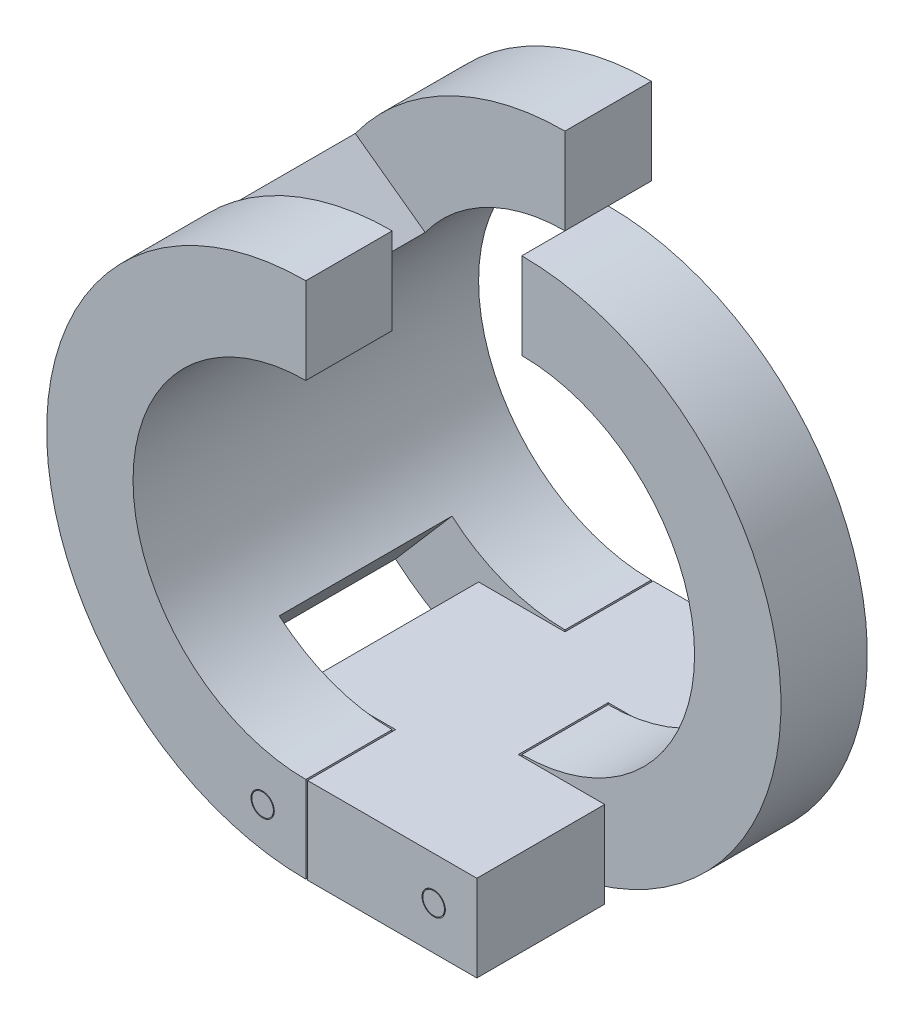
ISO-10303-21;
HEADER;
FILE_DESCRIPTION(('STEP AP214'),'2;1');
FILE_NAME('part.step','',(''),(''),'','','');
FILE_SCHEMA(('AUTOMOTIVE_DESIGN { 1 0 10303 214 1 1 1 1 }'));
ENDSEC;
DATA;
#1=APPLICATION_CONTEXT('core data for automotive mechanical design processes');
#2=APPLICATION_PROTOCOL_DEFINITION('international standard','automotive_design',2000,#1);
#3=PRODUCT_CONTEXT('',#1,'mechanical');
#4=PRODUCT('Part','Part','',(#3));
#5=PRODUCT_RELATED_PRODUCT_CATEGORY('part','',(#4));
#6=PRODUCT_DEFINITION_FORMATION('','',#4);
#7=PRODUCT_DEFINITION_CONTEXT('part definition',#1,'design');
#8=PRODUCT_DEFINITION('design','',#6,#7);
#9=PRODUCT_DEFINITION_SHAPE('','',#8);
#10=(LENGTH_UNIT() NAMED_UNIT(*) SI_UNIT(.MILLI.,.METRE.));
#11=(NAMED_UNIT(*) PLANE_ANGLE_UNIT() SI_UNIT($,.RADIAN.));
#12=(NAMED_UNIT(*) SI_UNIT($,.STERADIAN.) SOLID_ANGLE_UNIT());
#13=UNCERTAINTY_MEASURE_WITH_UNIT(LENGTH_MEASURE(1.E-05),#10,'distance_accuracy_value','');
#14=(GEOMETRIC_REPRESENTATION_CONTEXT(3) GLOBAL_UNCERTAINTY_ASSIGNED_CONTEXT((#13)) GLOBAL_UNIT_ASSIGNED_CONTEXT((#10,
#11,#12)) REPRESENTATION_CONTEXT('',''));
#15=CARTESIAN_POINT('',(0.,0.,0.));
#16=DIRECTION('',(0.,0.,1.));
#17=DIRECTION('',(1.,0.,0.));
#18=AXIS2_PLACEMENT_3D('',#15,#16,#17);
#19=CARTESIAN_POINT('',(9.398,-15.875,0.));
#20=DIRECTION('',(0.,0.,1.));
#21=DIRECTION('',(1.,0.,0.));
#22=AXIS2_PLACEMENT_3D('',#19,#20,#21);
#23=CYLINDRICAL_SURFACE('',#22,0.793749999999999);
#24=CARTESIAN_POINT('',(9.398,-15.875,0.));
#25=DIRECTION('',(0.,0.,1.));
#26=DIRECTION('',(1.,0.,0.));
#27=AXIS2_PLACEMENT_3D('',#24,#25,#26);
#28=CIRCLE('',#27,0.793749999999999);
#29=CARTESIAN_POINT('',(10.19175,-15.875,0.));
#30=VERTEX_POINT('',#29);
#31=EDGE_CURVE('E49',#30,#30,#28,.T.);
#32=ORIENTED_EDGE('',*,*,#31,.T.);
#33=EDGE_LOOP('',(#32));
#34=FACE_BOUND('',#33,.T.);
#35=CARTESIAN_POINT('',(9.398,-15.875,25.4));
#36=DIRECTION('',(0.,0.,1.));
#37=DIRECTION('',(1.,0.,0.));
#38=AXIS2_PLACEMENT_3D('',#35,#36,#37);
#39=CIRCLE('',#38,0.793749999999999);
#40=CARTESIAN_POINT('',(10.19175,-15.875,25.4));
#41=VERTEX_POINT('',#40);
#42=EDGE_CURVE('E11',#41,#41,#39,.T.);
#43=ORIENTED_EDGE('',*,*,#42,.F.);
#44=EDGE_LOOP('',(#43));
#45=FACE_BOUND('',#44,.T.);
#46=ADVANCED_FACE('F45',(#34,#45),#23,.T.);
#47=CARTESIAN_POINT('',(9.398,-15.875,0.));
#48=DIRECTION('',(0.,0.,1.));
#49=DIRECTION('',(1.,0.,0.));
#50=AXIS2_PLACEMENT_3D('',#47,#48,#49);
#51=PLANE('',#50);
#52=ORIENTED_EDGE('',*,*,#31,.F.);
#53=EDGE_LOOP('',(#52));
#54=FACE_BOUND('',#53,.T.);
#55=ADVANCED_FACE('F47',(#54),#51,.F.);
#56=CARTESIAN_POINT('',(9.398,-15.875,25.4));
#57=DIRECTION('',(0.,0.,1.));
#58=DIRECTION('',(1.,0.,0.));
#59=AXIS2_PLACEMENT_3D('',#56,#57,#58);
#60=PLANE('',#59);
#61=ORIENTED_EDGE('',*,*,#42,.T.);
#62=EDGE_LOOP('',(#61));
#63=FACE_BOUND('',#62,.T.);
#64=ADVANCED_FACE('F61',(#63),#60,.T.);
#65=CLOSED_SHELL('',(#46,#55,#64));
#66=MANIFOLD_SOLID_BREP('B2',#65);
#67=CARTESIAN_POINT('',(-3.175,-15.875,0.));
#68=DIRECTION('',(0.,0.,1.));
#69=DIRECTION('',(1.,0.,0.));
#70=AXIS2_PLACEMENT_3D('',#67,#68,#69);
#71=CYLINDRICAL_SURFACE('',#70,0.79375);
#72=CARTESIAN_POINT('',(-3.175,-15.875,0.));
#73=DIRECTION('',(0.,0.,1.));
#74=DIRECTION('',(1.,0.,0.));
#75=AXIS2_PLACEMENT_3D('',#72,#73,#74);
#76=CIRCLE('',#75,0.79375);
#77=CARTESIAN_POINT('',(-2.38125,-15.875,0.));
#78=VERTEX_POINT('',#77);
#79=EDGE_CURVE('E44',#78,#78,#76,.T.);
#80=ORIENTED_EDGE('',*,*,#79,.T.);
#81=EDGE_LOOP('',(#80));
#82=FACE_BOUND('',#81,.T.);
#83=CARTESIAN_POINT('',(-3.175,-15.875,25.4));
#84=DIRECTION('',(0.,0.,1.));
#85=DIRECTION('',(1.,0.,0.));
#86=AXIS2_PLACEMENT_3D('',#83,#84,#85);
#87=CIRCLE('',#86,0.79375);
#88=CARTESIAN_POINT('',(-2.38125,-15.875,25.4));
#89=VERTEX_POINT('',#88);
#90=EDGE_CURVE('E98',#89,#89,#87,.T.);
#91=ORIENTED_EDGE('',*,*,#90,.F.);
#92=EDGE_LOOP('',(#91));
#93=FACE_BOUND('',#92,.T.);
#94=ADVANCED_FACE('F95',(#82,#93),#71,.T.);
#95=CARTESIAN_POINT('',(-3.175,-15.875,0.));
#96=DIRECTION('',(0.,0.,1.));
#97=DIRECTION('',(1.,0.,0.));
#98=AXIS2_PLACEMENT_3D('',#95,#96,#97);
#99=PLANE('',#98);
#100=ORIENTED_EDGE('',*,*,#79,.F.);
#101=EDGE_LOOP('',(#100));
#102=FACE_BOUND('',#101,.T.);
#103=ADVANCED_FACE('F110',(#102),#99,.F.);
#104=CARTESIAN_POINT('',(-3.175,-15.875,25.4));
#105=DIRECTION('',(0.,0.,1.));
#106=DIRECTION('',(1.,0.,0.));
#107=AXIS2_PLACEMENT_3D('',#104,#105,#106);
#108=PLANE('',#107);
#109=ORIENTED_EDGE('',*,*,#90,.T.);
#110=EDGE_LOOP('',(#109));
#111=FACE_BOUND('',#110,.T.);
#112=ADVANCED_FACE('F107',(#111),#108,.T.);
#113=CLOSED_SHELL('',(#94,#103,#112));
#114=MANIFOLD_SOLID_BREP('B6',#113);
#115=CARTESIAN_POINT('',(0.,-12.7,25.4));
#116=DIRECTION('',(0.,0.,1.));
#117=DIRECTION('',(1.,0.,0.));
#118=AXIS2_PLACEMENT_3D('',#115,#116,#117);
#119=PLANE('',#118);
#120=CARTESIAN_POINT('',(9.398,-15.875,25.4));
#121=DIRECTION('',(0.,0.,1.));
#122=DIRECTION('',(1.,0.,0.));
#123=AXIS2_PLACEMENT_3D('',#120,#121,#122);
#124=CIRCLE('',#123,0.85725);
#125=CARTESIAN_POINT('',(10.25525,-15.875,25.4));
#126=VERTEX_POINT('',#125);
#127=EDGE_CURVE('E266',#126,#126,#124,.T.);
#128=ORIENTED_EDGE('',*,*,#127,.F.);
#129=EDGE_LOOP('',(#128));
#130=FACE_BOUND('',#129,.T.);
#131=DIRECTION('',(-1.,0.,0.));
#132=VECTOR('',#131,1.);
#133=CARTESIAN_POINT('',(0.,-19.05,25.4));
#134=LINE('',#133,#132);
#135=CARTESIAN_POINT('',(12.573,-19.05,25.4));
#136=VERTEX_POINT('',#135);
#137=CARTESIAN_POINT('',(0.127000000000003,-19.05,25.4));
#138=VERTEX_POINT('',#137);
#139=EDGE_CURVE('E263',#136,#138,#134,.T.);
#140=ORIENTED_EDGE('',*,*,#139,.F.);
#141=DIRECTION('',(0.,-1.,0.));
#142=VECTOR('',#141,1.);
#143=CARTESIAN_POINT('',(12.573,-12.7,25.4));
#144=LINE('',#143,#142);
#145=CARTESIAN_POINT('',(12.573,-12.7,25.4));
#146=VERTEX_POINT('',#145);
#147=EDGE_CURVE('E93',#146,#136,#144,.T.);
#148=ORIENTED_EDGE('',*,*,#147,.F.);
#149=DIRECTION('',(-1.,0.,0.));
#150=VECTOR('',#149,1.);
#151=CARTESIAN_POINT('',(0.,-12.7,25.4));
#152=LINE('',#151,#150);
#153=CARTESIAN_POINT('',(0.126999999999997,-12.7,25.4));
#154=VERTEX_POINT('',#153);
#155=EDGE_CURVE('E296',#146,#154,#152,.T.);
#156=ORIENTED_EDGE('',*,*,#155,.T.);
#157=DIRECTION('',(0.,-1.,0.));
#158=VECTOR('',#157,1.);
#159=CARTESIAN_POINT('',(0.126999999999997,-12.7,25.4));
#160=LINE('',#159,#158);
#161=EDGE_CURVE('E162',#154,#138,#160,.T.);
#162=ORIENTED_EDGE('',*,*,#161,.T.);
#163=EDGE_LOOP('',(#140,#148,#156,#162));
#164=FACE_BOUND('',#163,.T.);
#165=ADVANCED_FACE('F145',(#130,#164),#119,.T.);
#166=CARTESIAN_POINT('',(12.573,-12.7,0.));
#167=DIRECTION('',(1.,0.,0.));
#168=DIRECTION('',(0.,1.,0.));
#169=AXIS2_PLACEMENT_3D('',#166,#167,#168);
#170=PLANE('',#169);
#171=DIRECTION('',(0.,0.,1.));
#172=VECTOR('',#171,1.);
#173=CARTESIAN_POINT('',(12.573,-19.05,0.));
#174=LINE('',#173,#172);
#175=CARTESIAN_POINT('',(12.573,-19.05,16.002));
#176=VERTEX_POINT('',#175);
#177=EDGE_CURVE('E265',#176,#136,#174,.T.);
#178=ORIENTED_EDGE('',*,*,#177,.F.);
#179=DIRECTION('',(0.,-1.,0.));
#180=VECTOR('',#179,1.);
#181=CARTESIAN_POINT('',(12.573,-12.7,16.002));
#182=LINE('',#181,#180);
#183=CARTESIAN_POINT('',(12.573,-12.7,16.002));
#184=VERTEX_POINT('',#183);
#185=EDGE_CURVE('E154',#184,#176,#182,.T.);
#186=ORIENTED_EDGE('',*,*,#185,.F.);
#187=DIRECTION('',(0.,0.,1.));
#188=VECTOR('',#187,1.);
#189=CARTESIAN_POINT('',(12.573,-12.7,0.));
#190=LINE('',#189,#188);
#191=EDGE_CURVE('E334',#184,#146,#190,.T.);
#192=ORIENTED_EDGE('',*,*,#191,.T.);
#193=ORIENTED_EDGE('',*,*,#147,.T.);
#194=EDGE_LOOP('',(#178,#186,#192,#193));
#195=FACE_BOUND('',#194,.T.);
#196=ADVANCED_FACE('F322',(#195),#170,.T.);
#197=CARTESIAN_POINT('',(0.,-12.7,16.002));
#198=DIRECTION('',(0.,0.,-1.));
#199=DIRECTION('',(-1.,0.,0.));
#200=AXIS2_PLACEMENT_3D('',#197,#198,#199);
#201=PLANE('',#200);
#202=CARTESIAN_POINT('',(9.398,-15.875,16.002));
#203=DIRECTION('',(0.,0.,-1.));
#204=DIRECTION('',(-1.,0.,0.));
#205=AXIS2_PLACEMENT_3D('',#202,#203,#204);
#206=CIRCLE('',#205,0.85725);
#207=CARTESIAN_POINT('',(8.54075,-15.875,16.002));
#208=VERTEX_POINT('',#207);
#209=EDGE_CURVE('E373',#208,#208,#206,.T.);
#210=ORIENTED_EDGE('',*,*,#209,.F.);
#211=EDGE_LOOP('',(#210));
#212=FACE_BOUND('',#211,.T.);
#213=DIRECTION('',(1.,0.,0.));
#214=VECTOR('',#213,1.);
#215=CARTESIAN_POINT('',(0.,-19.05,16.002));
#216=LINE('',#215,#214);
#217=CARTESIAN_POINT('',(6.223,-19.05,16.002));
#218=VERTEX_POINT('',#217);
#219=EDGE_CURVE('E269',#218,#176,#216,.T.);
#220=ORIENTED_EDGE('',*,*,#219,.F.);
#221=DIRECTION('',(0.,-1.,0.));
#222=VECTOR('',#221,1.);
#223=CARTESIAN_POINT('',(6.223,-12.7,16.002));
#224=LINE('',#223,#222);
#225=CARTESIAN_POINT('',(6.223,-12.7,16.002));
#226=VERTEX_POINT('',#225);
#227=EDGE_CURVE('E310',#226,#218,#224,.T.);
#228=ORIENTED_EDGE('',*,*,#227,.F.);
#229=DIRECTION('',(1.,0.,0.));
#230=VECTOR('',#229,1.);
#231=CARTESIAN_POINT('',(0.,-12.7,16.002));
#232=LINE('',#231,#230);
#233=EDGE_CURVE('E318',#226,#184,#232,.T.);
#234=ORIENTED_EDGE('',*,*,#233,.T.);
#235=ORIENTED_EDGE('',*,*,#185,.T.);
#236=EDGE_LOOP('',(#220,#228,#234,#235));
#237=FACE_BOUND('',#236,.T.);
#238=ADVANCED_FACE('F316',(#212,#237),#201,.T.);
#239=CARTESIAN_POINT('',(6.223,-12.7,0.));
#240=DIRECTION('',(1.,0.,0.));
#241=DIRECTION('',(0.,1.,0.));
#242=AXIS2_PLACEMENT_3D('',#239,#240,#241);
#243=PLANE('',#242);
#244=DIRECTION('',(0.,0.,1.));
#245=VECTOR('',#244,1.);
#246=CARTESIAN_POINT('',(6.223,-19.05,0.));
#247=LINE('',#246,#245);
#248=CARTESIAN_POINT('',(6.223,-19.05,9.398));
#249=VERTEX_POINT('',#248);
#250=EDGE_CURVE('E272',#249,#218,#247,.T.);
#251=ORIENTED_EDGE('',*,*,#250,.F.);
#252=DIRECTION('',(0.,-1.,0.));
#253=VECTOR('',#252,1.);
#254=CARTESIAN_POINT('',(6.223,-12.7,9.398));
#255=LINE('',#254,#253);
#256=CARTESIAN_POINT('',(6.223,-12.7,9.398));
#257=VERTEX_POINT('',#256);
#258=EDGE_CURVE('E308',#257,#249,#255,.T.);
#259=ORIENTED_EDGE('',*,*,#258,.F.);
#260=DIRECTION('',(0.,0.,1.));
#261=VECTOR('',#260,1.);
#262=CARTESIAN_POINT('',(6.223,-12.7,0.));
#263=LINE('',#262,#261);
#264=EDGE_CURVE('E331',#257,#226,#263,.T.);
#265=ORIENTED_EDGE('',*,*,#264,.T.);
#266=ORIENTED_EDGE('',*,*,#227,.T.);
#267=EDGE_LOOP('',(#251,#259,#265,#266));
#268=FACE_BOUND('',#267,.T.);
#269=ADVANCED_FACE('F328',(#268),#243,.T.);
#270=CARTESIAN_POINT('',(0.,-12.7,9.398));
#271=DIRECTION('',(0.,0.,1.));
#272=DIRECTION('',(1.,0.,0.));
#273=AXIS2_PLACEMENT_3D('',#270,#271,#272);
#274=PLANE('',#273);
#275=CARTESIAN_POINT('',(9.398,-15.875,9.398));
#276=DIRECTION('',(0.,0.,1.));
#277=DIRECTION('',(1.,0.,0.));
#278=AXIS2_PLACEMENT_3D('',#275,#276,#277);
#279=CIRCLE('',#278,0.85725);
#280=CARTESIAN_POINT('',(10.25525,-15.875,9.398));
#281=VERTEX_POINT('',#280);
#282=EDGE_CURVE('E376',#281,#281,#279,.T.);
#283=ORIENTED_EDGE('',*,*,#282,.F.);
#284=EDGE_LOOP('',(#283));
#285=FACE_BOUND('',#284,.T.);
#286=DIRECTION('',(-1.,0.,0.));
#287=VECTOR('',#286,1.);
#288=CARTESIAN_POINT('',(0.,-19.05,9.398));
#289=LINE('',#288,#287);
#290=CARTESIAN_POINT('',(12.573,-19.05,9.398));
#291=VERTEX_POINT('',#290);
#292=EDGE_CURVE('E275',#291,#249,#289,.T.);
#293=ORIENTED_EDGE('',*,*,#292,.F.);
#294=DIRECTION('',(0.,-1.,0.));
#295=VECTOR('',#294,1.);
#296=CARTESIAN_POINT('',(12.573,-12.7,9.398));
#297=LINE('',#296,#295);
#298=CARTESIAN_POINT('',(12.573,-12.7,9.398));
#299=VERTEX_POINT('',#298);
#300=EDGE_CURVE('E306',#299,#291,#297,.T.);
#301=ORIENTED_EDGE('',*,*,#300,.F.);
#302=DIRECTION('',(-1.,0.,0.));
#303=VECTOR('',#302,1.);
#304=CARTESIAN_POINT('',(0.,-12.7,9.398));
#305=LINE('',#304,#303);
#306=EDGE_CURVE('E336',#299,#257,#305,.T.);
#307=ORIENTED_EDGE('',*,*,#306,.T.);
#308=ORIENTED_EDGE('',*,*,#258,.T.);
#309=EDGE_LOOP('',(#293,#301,#307,#308));
#310=FACE_BOUND('',#309,.T.);
#311=ADVANCED_FACE('F422',(#285,#310),#274,.T.);
#312=CARTESIAN_POINT('',(12.573,-12.7,0.));
#313=DIRECTION('',(1.,0.,0.));
#314=DIRECTION('',(0.,1.,0.));
#315=AXIS2_PLACEMENT_3D('',#312,#313,#314);
#316=PLANE('',#315);
#317=DIRECTION('',(0.,0.,1.));
#318=VECTOR('',#317,1.);
#319=CARTESIAN_POINT('',(12.573,-19.05,0.));
#320=LINE('',#319,#318);
#321=CARTESIAN_POINT('',(12.573,-19.05,0.));
#322=VERTEX_POINT('',#321);
#323=EDGE_CURVE('E278',#322,#291,#320,.T.);
#324=ORIENTED_EDGE('',*,*,#323,.F.);
#325=DIRECTION('',(0.,-1.,0.));
#326=VECTOR('',#325,1.);
#327=CARTESIAN_POINT('',(12.573,-12.7,0.));
#328=LINE('',#327,#326);
#329=CARTESIAN_POINT('',(12.573,-12.7,0.));
#330=VERTEX_POINT('',#329);
#331=EDGE_CURVE('E304',#330,#322,#328,.T.);
#332=ORIENTED_EDGE('',*,*,#331,.F.);
#333=DIRECTION('',(0.,0.,1.));
#334=VECTOR('',#333,1.);
#335=CARTESIAN_POINT('',(12.573,-12.7,0.));
#336=LINE('',#335,#334);
#337=EDGE_CURVE('E342',#330,#299,#336,.T.);
#338=ORIENTED_EDGE('',*,*,#337,.T.);
#339=ORIENTED_EDGE('',*,*,#300,.T.);
#340=EDGE_LOOP('',(#324,#332,#338,#339));
#341=FACE_BOUND('',#340,.T.);
#342=ADVANCED_FACE('F419',(#341),#316,.T.);
#343=CARTESIAN_POINT('',(0.,-12.7,0.));
#344=DIRECTION('',(0.,0.,-1.));
#345=DIRECTION('',(-1.,0.,0.));
#346=AXIS2_PLACEMENT_3D('',#343,#344,#345);
#347=PLANE('',#346);
#348=CARTESIAN_POINT('',(9.398,-15.875,0.));
#349=DIRECTION('',(0.,0.,1.));
#350=DIRECTION('',(1.,0.,0.));
#351=AXIS2_PLACEMENT_3D('',#348,#349,#350);
#352=CIRCLE('',#351,0.85725);
#353=CARTESIAN_POINT('',(10.25525,-15.875,0.));
#354=VERTEX_POINT('',#353);
#355=EDGE_CURVE('E384',#354,#354,#352,.T.);
#356=ORIENTED_EDGE('',*,*,#355,.T.);
#357=EDGE_LOOP('',(#356));
#358=FACE_BOUND('',#357,.T.);
#359=DIRECTION('',(1.,0.,0.));
#360=VECTOR('',#359,1.);
#361=CARTESIAN_POINT('',(0.,-19.05,0.));
#362=LINE('',#361,#360);
#363=CARTESIAN_POINT('',(0.127000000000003,-19.05,0.));
#364=VERTEX_POINT('',#363);
#365=EDGE_CURVE('E281',#364,#322,#362,.T.);
#366=ORIENTED_EDGE('',*,*,#365,.F.);
#367=DIRECTION('',(0.,-1.,0.));
#368=VECTOR('',#367,1.);
#369=CARTESIAN_POINT('',(0.126999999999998,-12.7,0.));
#370=LINE('',#369,#368);
#371=CARTESIAN_POINT('',(0.126999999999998,-12.7,0.));
#372=VERTEX_POINT('',#371);
#373=EDGE_CURVE('E302',#372,#364,#370,.T.);
#374=ORIENTED_EDGE('',*,*,#373,.F.);
#375=DIRECTION('',(1.,0.,0.));
#376=VECTOR('',#375,1.);
#377=CARTESIAN_POINT('',(0.,-12.7,0.));
#378=LINE('',#377,#376);
#379=EDGE_CURVE('E345',#372,#330,#378,.T.);
#380=ORIENTED_EDGE('',*,*,#379,.T.);
#381=ORIENTED_EDGE('',*,*,#331,.T.);
#382=EDGE_LOOP('',(#366,#374,#380,#381));
#383=FACE_BOUND('',#382,.T.);
#384=ADVANCED_FACE('F413',(#358,#383),#347,.T.);
#385=CARTESIAN_POINT('',(0.126999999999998,-12.7,0.));
#386=DIRECTION('',(-1.,0.,0.));
#387=DIRECTION('',(0.,-1.,0.));
#388=AXIS2_PLACEMENT_3D('',#385,#386,#387);
#389=PLANE('',#388);
#390=DIRECTION('',(0.,0.,-1.));
#391=VECTOR('',#390,1.);
#392=CARTESIAN_POINT('',(0.127000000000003,-19.05,0.));
#393=LINE('',#392,#391);
#394=CARTESIAN_POINT('',(0.127000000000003,-19.05,6.477));
#395=VERTEX_POINT('',#394);
#396=EDGE_CURVE('E284',#395,#364,#393,.T.);
#397=ORIENTED_EDGE('',*,*,#396,.F.);
#398=DIRECTION('',(0.,-1.,0.));
#399=VECTOR('',#398,1.);
#400=CARTESIAN_POINT('',(0.126999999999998,-12.7,6.477));
#401=LINE('',#400,#399);
#402=CARTESIAN_POINT('',(0.126999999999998,-12.7,6.477));
#403=VERTEX_POINT('',#402);
#404=EDGE_CURVE('E300',#403,#395,#401,.T.);
#405=ORIENTED_EDGE('',*,*,#404,.F.);
#406=DIRECTION('',(0.,0.,-1.));
#407=VECTOR('',#406,1.);
#408=CARTESIAN_POINT('',(0.126999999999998,-12.7,0.));
#409=LINE('',#408,#407);
#410=EDGE_CURVE('E348',#403,#372,#409,.T.);
#411=ORIENTED_EDGE('',*,*,#410,.T.);
#412=ORIENTED_EDGE('',*,*,#373,.T.);
#413=EDGE_LOOP('',(#397,#405,#411,#412));
#414=FACE_BOUND('',#413,.T.);
#415=ADVANCED_FACE('F406',(#414),#389,.T.);
#416=CARTESIAN_POINT('',(0.,-12.7,6.477));
#417=DIRECTION('',(0.,0.,-1.));
#418=DIRECTION('',(-1.,0.,0.));
#419=AXIS2_PLACEMENT_3D('',#416,#417,#418);
#420=PLANE('',#419);
#421=CARTESIAN_POINT('',(-3.175,-15.875,6.477));
#422=DIRECTION('',(0.,0.,-1.));
#423=DIRECTION('',(-1.,0.,0.));
#424=AXIS2_PLACEMENT_3D('',#421,#422,#423);
#425=CIRCLE('',#424,0.85725);
#426=CARTESIAN_POINT('',(-4.03225,-15.875,6.477));
#427=VERTEX_POINT('',#426);
#428=EDGE_CURVE('E381',#427,#427,#425,.T.);
#429=ORIENTED_EDGE('',*,*,#428,.F.);
#430=EDGE_LOOP('',(#429));
#431=FACE_BOUND('',#430,.T.);
#432=DIRECTION('',(1.,0.,0.));
#433=VECTOR('',#432,1.);
#434=CARTESIAN_POINT('',(0.,-19.05,6.477));
#435=LINE('',#434,#433);
#436=CARTESIAN_POINT('',(-6.223,-19.05,6.477));
#437=VERTEX_POINT('',#436);
#438=EDGE_CURVE('E287',#437,#395,#435,.T.);
#439=ORIENTED_EDGE('',*,*,#438,.F.);
#440=DIRECTION('',(0.,-1.,0.));
#441=VECTOR('',#440,1.);
#442=CARTESIAN_POINT('',(-6.223,-12.7,6.477));
#443=LINE('',#442,#441);
#444=CARTESIAN_POINT('',(-6.223,-12.7,6.477));
#445=VERTEX_POINT('',#444);
#446=EDGE_CURVE('E245',#445,#437,#443,.T.);
#447=ORIENTED_EDGE('',*,*,#446,.F.);
#448=DIRECTION('',(1.,0.,0.));
#449=VECTOR('',#448,1.);
#450=CARTESIAN_POINT('',(0.,-12.7,6.477));
#451=LINE('',#450,#449);
#452=EDGE_CURVE('E255',#445,#403,#451,.T.);
#453=ORIENTED_EDGE('',*,*,#452,.T.);
#454=ORIENTED_EDGE('',*,*,#404,.T.);
#455=EDGE_LOOP('',(#439,#447,#453,#454));
#456=FACE_BOUND('',#455,.T.);
#457=ADVANCED_FACE('F352',(#431,#456),#420,.T.);
#458=CARTESIAN_POINT('',(-6.223,-12.7,0.));
#459=DIRECTION('',(-1.,0.,0.));
#460=DIRECTION('',(0.,-1.,0.));
#461=AXIS2_PLACEMENT_3D('',#458,#459,#460);
#462=PLANE('',#461);
#463=DIRECTION('',(0.,0.,-1.));
#464=VECTOR('',#463,1.);
#465=CARTESIAN_POINT('',(-6.223,-19.05,0.));
#466=LINE('',#465,#464);
#467=CARTESIAN_POINT('',(-6.223,-19.05,18.923));
#468=VERTEX_POINT('',#467);
#469=EDGE_CURVE('E241',#468,#437,#466,.T.);
#470=ORIENTED_EDGE('',*,*,#469,.F.);
#471=DIRECTION('',(0.,-1.,0.));
#472=VECTOR('',#471,1.);
#473=CARTESIAN_POINT('',(-6.223,-12.7,18.923));
#474=LINE('',#473,#472);
#475=CARTESIAN_POINT('',(-6.223,-12.7,18.923));
#476=VERTEX_POINT('',#475);
#477=EDGE_CURVE('E236',#476,#468,#474,.T.);
#478=ORIENTED_EDGE('',*,*,#477,.F.);
#479=DIRECTION('',(0.,0.,-1.));
#480=VECTOR('',#479,1.);
#481=CARTESIAN_POINT('',(-6.223,-12.7,0.));
#482=LINE('',#481,#480);
#483=EDGE_CURVE('E239',#476,#445,#482,.T.);
#484=ORIENTED_EDGE('',*,*,#483,.T.);
#485=ORIENTED_EDGE('',*,*,#446,.T.);
#486=EDGE_LOOP('',(#470,#478,#484,#485));
#487=FACE_BOUND('',#486,.T.);
#488=ADVANCED_FACE('F238',(#487),#462,.T.);
#489=CARTESIAN_POINT('',(0.,-12.7,18.923));
#490=DIRECTION('',(0.,0.,1.));
#491=DIRECTION('',(1.,0.,0.));
#492=AXIS2_PLACEMENT_3D('',#489,#490,#491);
#493=PLANE('',#492);
#494=CARTESIAN_POINT('',(-3.175,-15.875,18.923));
#495=DIRECTION('',(0.,0.,1.));
#496=DIRECTION('',(1.,0.,0.));
#497=AXIS2_PLACEMENT_3D('',#494,#495,#496);
#498=CIRCLE('',#497,0.85725);
#499=CARTESIAN_POINT('',(-2.31775,-15.875,18.923));
#500=VERTEX_POINT('',#499);
#501=EDGE_CURVE('E148',#500,#500,#498,.T.);
#502=ORIENTED_EDGE('',*,*,#501,.F.);
#503=EDGE_LOOP('',(#502));
#504=FACE_BOUND('',#503,.T.);
#505=DIRECTION('',(-1.,0.,0.));
#506=VECTOR('',#505,1.);
#507=CARTESIAN_POINT('',(0.,-19.05,18.923));
#508=LINE('',#507,#506);
#509=CARTESIAN_POINT('',(0.127000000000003,-19.05,18.923));
#510=VERTEX_POINT('',#509);
#511=EDGE_CURVE('E291',#510,#468,#508,.T.);
#512=ORIENTED_EDGE('',*,*,#511,.F.);
#513=DIRECTION('',(0.,-1.,0.));
#514=VECTOR('',#513,1.);
#515=CARTESIAN_POINT('',(0.126999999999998,-12.7,18.923));
#516=LINE('',#515,#514);
#517=CARTESIAN_POINT('',(0.126999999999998,-12.7,18.923));
#518=VERTEX_POINT('',#517);
#519=EDGE_CURVE('E199',#518,#510,#516,.T.);
#520=ORIENTED_EDGE('',*,*,#519,.F.);
#521=DIRECTION('',(-1.,0.,0.));
#522=VECTOR('',#521,1.);
#523=CARTESIAN_POINT('',(0.,-12.7,18.923));
#524=LINE('',#523,#522);
#525=EDGE_CURVE('E252',#518,#476,#524,.T.);
#526=ORIENTED_EDGE('',*,*,#525,.T.);
#527=ORIENTED_EDGE('',*,*,#477,.T.);
#528=EDGE_LOOP('',(#512,#520,#526,#527));
#529=FACE_BOUND('',#528,.T.);
#530=ADVANCED_FACE('F257',(#504,#529),#493,.T.);
#531=CARTESIAN_POINT('',(0.127,-12.7,0.));
#532=DIRECTION('',(-1.,0.,0.));
#533=DIRECTION('',(0.,-1.,0.));
#534=AXIS2_PLACEMENT_3D('',#531,#532,#533);
#535=PLANE('',#534);
#536=DIRECTION('',(0.,0.,-1.));
#537=VECTOR('',#536,1.);
#538=CARTESIAN_POINT('',(0.127000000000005,-19.05,0.));
#539=LINE('',#538,#537);
#540=EDGE_CURVE('E293',#138,#510,#539,.T.);
#541=ORIENTED_EDGE('',*,*,#540,.F.);
#542=ORIENTED_EDGE('',*,*,#161,.F.);
#543=DIRECTION('',(0.,0.,-1.));
#544=VECTOR('',#543,1.);
#545=CARTESIAN_POINT('',(0.127,-12.7,0.));
#546=LINE('',#545,#544);
#547=EDGE_CURVE('E258',#154,#518,#546,.T.);
#548=ORIENTED_EDGE('',*,*,#547,.T.);
#549=ORIENTED_EDGE('',*,*,#519,.T.);
#550=EDGE_LOOP('',(#541,#542,#548,#549));
#551=FACE_BOUND('',#550,.T.);
#552=ADVANCED_FACE('F354',(#551),#535,.T.);
#553=CARTESIAN_POINT('',(0.,-12.7,0.));
#554=DIRECTION('',(0.,1.,0.));
#555=DIRECTION('',(-1.,0.,0.));
#556=AXIS2_PLACEMENT_3D('',#553,#554,#555);
#557=PLANE('',#556);
#558=ORIENTED_EDGE('',*,*,#155,.F.);
#559=ORIENTED_EDGE('',*,*,#191,.F.);
#560=ORIENTED_EDGE('',*,*,#233,.F.);
#561=ORIENTED_EDGE('',*,*,#264,.F.);
#562=ORIENTED_EDGE('',*,*,#306,.F.);
#563=ORIENTED_EDGE('',*,*,#337,.F.);
#564=ORIENTED_EDGE('',*,*,#379,.F.);
#565=ORIENTED_EDGE('',*,*,#410,.F.);
#566=ORIENTED_EDGE('',*,*,#452,.F.);
#567=ORIENTED_EDGE('',*,*,#483,.F.);
#568=ORIENTED_EDGE('',*,*,#525,.F.);
#569=ORIENTED_EDGE('',*,*,#547,.F.);
#570=EDGE_LOOP('',(#558,#559,#560,#561,#562,#563,#564,#565,#566,#567,#568,#569));
#571=FACE_BOUND('',#570,.T.);
#572=ADVANCED_FACE('F250',(#571),#557,.T.);
#573=CARTESIAN_POINT('',(0.,-19.05,0.));
#574=DIRECTION('',(0.,1.,0.));
#575=DIRECTION('',(-1.,0.,0.));
#576=AXIS2_PLACEMENT_3D('',#573,#574,#575);
#577=PLANE('',#576);
#578=ORIENTED_EDGE('',*,*,#139,.T.);
#579=ORIENTED_EDGE('',*,*,#540,.T.);
#580=ORIENTED_EDGE('',*,*,#511,.T.);
#581=ORIENTED_EDGE('',*,*,#469,.T.);
#582=ORIENTED_EDGE('',*,*,#438,.T.);
#583=ORIENTED_EDGE('',*,*,#396,.T.);
#584=ORIENTED_EDGE('',*,*,#365,.T.);
#585=ORIENTED_EDGE('',*,*,#323,.T.);
#586=ORIENTED_EDGE('',*,*,#292,.T.);
#587=ORIENTED_EDGE('',*,*,#250,.T.);
#588=ORIENTED_EDGE('',*,*,#219,.T.);
#589=ORIENTED_EDGE('',*,*,#177,.T.);
#590=EDGE_LOOP('',(#578,#579,#580,#581,#582,#583,#584,#585,#586,#587,#588,#589));
#591=FACE_BOUND('',#590,.T.);
#592=ADVANCED_FACE('F324',(#591),#577,.F.);
#593=CARTESIAN_POINT('',(-3.175,-15.875,0.));
#594=DIRECTION('',(0.,0.,1.));
#595=DIRECTION('',(1.,0.,0.));
#596=AXIS2_PLACEMENT_3D('',#593,#594,#595);
#597=CYLINDRICAL_SURFACE('',#596,0.85725);
#598=ORIENTED_EDGE('',*,*,#428,.T.);
#599=EDGE_LOOP('',(#598));
#600=FACE_BOUND('',#599,.T.);
#601=ORIENTED_EDGE('',*,*,#501,.T.);
#602=EDGE_LOOP('',(#601));
#603=FACE_BOUND('',#602,.T.);
#604=ADVANCED_FACE('F391',(#600,#603),#597,.F.);
#605=CARTESIAN_POINT('',(9.398,-15.875,0.));
#606=DIRECTION('',(0.,0.,1.));
#607=DIRECTION('',(1.,0.,0.));
#608=AXIS2_PLACEMENT_3D('',#605,#606,#607);
#609=CYLINDRICAL_SURFACE('',#608,0.85725);
#610=ORIENTED_EDGE('',*,*,#282,.T.);
#611=EDGE_LOOP('',(#610));
#612=FACE_BOUND('',#611,.T.);
#613=ORIENTED_EDGE('',*,*,#355,.F.);
#614=EDGE_LOOP('',(#613));
#615=FACE_BOUND('',#614,.T.);
#616=ADVANCED_FACE('F393',(#612,#615),#609,.F.);
#617=ORIENTED_EDGE('',*,*,#127,.T.);
#618=EDGE_LOOP('',(#617));
#619=FACE_BOUND('',#618,.T.);
#620=ORIENTED_EDGE('',*,*,#209,.T.);
#621=EDGE_LOOP('',(#620));
#622=FACE_BOUND('',#621,.T.);
#623=ADVANCED_FACE('F400',(#619,#622),#609,.F.);
#624=CLOSED_SHELL('',(#165,#196,#238,#269,#311,#342,#384,#415,#457,#488,#530,#552,#572,#592,
#604,#616,#623));
#625=MANIFOLD_SOLID_BREP('B39',#624);
#626=CARTESIAN_POINT('',(6.35,19.05,9.525));
#627=DIRECTION('',(-1.,0.,0.));
#628=DIRECTION('',(0.,-1.,0.));
#629=AXIS2_PLACEMENT_3D('',#626,#627,#628);
#630=PLANE('',#629);
#631=DIRECTION('',(0.,0.,1.));
#632=VECTOR('',#631,1.);
#633=CARTESIAN_POINT('',(6.35,12.7,9.525));
#634=LINE('',#633,#632);
#635=CARTESIAN_POINT('',(6.35,12.7,9.525));
#636=VERTEX_POINT('',#635);
#637=CARTESIAN_POINT('',(6.35,12.7,15.875));
#638=VERTEX_POINT('',#637);
#639=EDGE_CURVE('E587',#636,#638,#634,.T.);
#640=ORIENTED_EDGE('',*,*,#639,.T.);
#641=DIRECTION('',(0.,-1.,0.));
#642=VECTOR('',#641,1.);
#643=CARTESIAN_POINT('',(6.35,19.05,15.875));
#644=LINE('',#643,#642);
#645=CARTESIAN_POINT('',(6.35,19.05,15.875));
#646=VERTEX_POINT('',#645);
#647=EDGE_CURVE('E589',#646,#638,#644,.T.);
#648=ORIENTED_EDGE('',*,*,#647,.F.);
#649=DIRECTION('',(0.,0.,1.));
#650=VECTOR('',#649,1.);
#651=CARTESIAN_POINT('',(6.35,19.05,9.525));
#652=LINE('',#651,#650);
#653=CARTESIAN_POINT('',(6.35,19.05,9.525));
#654=VERTEX_POINT('',#653);
#655=EDGE_CURVE('E143',#654,#646,#652,.T.);
#656=ORIENTED_EDGE('',*,*,#655,.F.);
#657=DIRECTION('',(0.,-1.,0.));
#658=VECTOR('',#657,1.);
#659=CARTESIAN_POINT('',(6.35,19.05,9.525));
#660=LINE('',#659,#658);
#661=EDGE_CURVE('E591',#654,#636,#660,.T.);
#662=ORIENTED_EDGE('',*,*,#661,.T.);
#663=EDGE_LOOP('',(#640,#648,#656,#662));
#664=FACE_BOUND('',#663,.T.);
#665=ADVANCED_FACE('F547',(#664),#630,.T.);
#666=CARTESIAN_POINT('',(6.35,0.,9.525));
#667=DIRECTION('',(0.,0.,1.));
#668=DIRECTION('',(1.,0.,0.));
#669=AXIS2_PLACEMENT_3D('',#666,#667,#668);
#670=CYLINDRICAL_SURFACE('',#669,19.05);
#671=ORIENTED_EDGE('',*,*,#655,.T.);
#672=CARTESIAN_POINT('',(6.35,0.,15.875));
#673=DIRECTION('',(0.,0.,-1.));
#674=DIRECTION('',(-1.,0.,0.));
#675=AXIS2_PLACEMENT_3D('',#672,#673,#674);
#676=CIRCLE('',#675,19.05);
#677=CARTESIAN_POINT('',(6.35,-19.05,15.875));
#678=VERTEX_POINT('',#677);
#679=EDGE_CURVE('E602',#646,#678,#676,.T.);
#680=ORIENTED_EDGE('',*,*,#679,.T.);
#681=DIRECTION('',(0.,0.,1.));
#682=VECTOR('',#681,1.);
#683=CARTESIAN_POINT('',(6.35,-19.05,9.525));
#684=LINE('',#683,#682);
#685=CARTESIAN_POINT('',(6.35,-19.05,9.525));
#686=VERTEX_POINT('',#685);
#687=EDGE_CURVE('E555',#686,#678,#684,.T.);
#688=ORIENTED_EDGE('',*,*,#687,.F.);
#689=CARTESIAN_POINT('',(6.35,0.,9.525));
#690=DIRECTION('',(0.,0.,-1.));
#691=DIRECTION('',(-1.,0.,0.));
#692=AXIS2_PLACEMENT_3D('',#689,#690,#691);
#693=CIRCLE('',#692,19.05);
#694=EDGE_CURVE('E568',#654,#686,#693,.T.);
#695=ORIENTED_EDGE('',*,*,#694,.F.);
#696=EDGE_LOOP('',(#671,#680,#688,#695));
#697=FACE_BOUND('',#696,.T.);
#698=ADVANCED_FACE('F624',(#697),#670,.T.);
#699=CARTESIAN_POINT('',(6.35,-12.7,9.525));
#700=DIRECTION('',(-1.,0.,0.));
#701=DIRECTION('',(0.,0.,1.));
#702=AXIS2_PLACEMENT_3D('',#699,#700,#701);
#703=PLANE('',#702);
#704=ORIENTED_EDGE('',*,*,#687,.T.);
#705=DIRECTION('',(0.,-1.,0.));
#706=VECTOR('',#705,1.);
#707=CARTESIAN_POINT('',(6.35,-12.7,15.875));
#708=LINE('',#707,#706);
#709=CARTESIAN_POINT('',(6.35,-12.7,15.875));
#710=VERTEX_POINT('',#709);
#711=EDGE_CURVE('E607',#710,#678,#708,.T.);
#712=ORIENTED_EDGE('',*,*,#711,.F.);
#713=DIRECTION('',(0.,0.,1.));
#714=VECTOR('',#713,1.);
#715=CARTESIAN_POINT('',(6.35,-12.7,9.525));
#716=LINE('',#715,#714);
#717=CARTESIAN_POINT('',(6.35,-12.7,9.525));
#718=VERTEX_POINT('',#717);
#719=EDGE_CURVE('E595',#718,#710,#716,.T.);
#720=ORIENTED_EDGE('',*,*,#719,.F.);
#721=DIRECTION('',(0.,-1.,0.));
#722=VECTOR('',#721,1.);
#723=CARTESIAN_POINT('',(6.35,-12.7,9.525));
#724=LINE('',#723,#722);
#725=EDGE_CURVE('E616',#718,#686,#724,.T.);
#726=ORIENTED_EDGE('',*,*,#725,.T.);
#727=EDGE_LOOP('',(#704,#712,#720,#726));
#728=FACE_BOUND('',#727,.T.);
#729=ADVANCED_FACE('F622',(#728),#703,.T.);
#730=CARTESIAN_POINT('',(6.35,0.,9.525));
#731=DIRECTION('',(0.,0.,1.));
#732=DIRECTION('',(1.,0.,0.));
#733=AXIS2_PLACEMENT_3D('',#730,#731,#732);
#734=CYLINDRICAL_SURFACE('',#733,12.7);
#735=ORIENTED_EDGE('',*,*,#719,.T.);
#736=CARTESIAN_POINT('',(6.35,0.,15.875));
#737=DIRECTION('',(0.,0.,1.));
#738=DIRECTION('',(1.,0.,0.));
#739=AXIS2_PLACEMENT_3D('',#736,#737,#738);
#740=CIRCLE('',#739,12.7);
#741=EDGE_CURVE('E600',#710,#638,#740,.T.);
#742=ORIENTED_EDGE('',*,*,#741,.T.);
#743=ORIENTED_EDGE('',*,*,#639,.F.);
#744=CARTESIAN_POINT('',(6.35,0.,9.525));
#745=DIRECTION('',(0.,0.,1.));
#746=DIRECTION('',(1.,0.,0.));
#747=AXIS2_PLACEMENT_3D('',#744,#745,#746);
#748=CIRCLE('',#747,12.7);
#749=EDGE_CURVE('E614',#718,#636,#748,.T.);
#750=ORIENTED_EDGE('',*,*,#749,.F.);
#751=EDGE_LOOP('',(#735,#742,#743,#750));
#752=FACE_BOUND('',#751,.T.);
#753=ADVANCED_FACE('F605',(#752),#734,.F.);
#754=CARTESIAN_POINT('',(6.35,0.,9.525));
#755=DIRECTION('',(0.,0.,1.));
#756=DIRECTION('',(1.,0.,0.));
#757=AXIS2_PLACEMENT_3D('',#754,#755,#756);
#758=PLANE('',#757);
#759=CARTESIAN_POINT('',(9.398,-15.875,9.525));
#760=DIRECTION('',(0.,0.,1.));
#761=DIRECTION('',(1.,0.,0.));
#762=AXIS2_PLACEMENT_3D('',#759,#760,#761);
#763=CIRCLE('',#762,0.85725);
#764=CARTESIAN_POINT('',(10.25525,-15.875,9.525));
#765=VERTEX_POINT('',#764);
#766=EDGE_CURVE('E603',#765,#765,#763,.T.);
#767=ORIENTED_EDGE('',*,*,#766,.T.);
#768=EDGE_LOOP('',(#767));
#769=FACE_BOUND('',#768,.T.);
#770=ORIENTED_EDGE('',*,*,#661,.F.);
#771=ORIENTED_EDGE('',*,*,#694,.T.);
#772=ORIENTED_EDGE('',*,*,#725,.F.);
#773=ORIENTED_EDGE('',*,*,#749,.T.);
#774=EDGE_LOOP('',(#770,#771,#772,#773));
#775=FACE_BOUND('',#774,.T.);
#776=ADVANCED_FACE('F625',(#769,#775),#758,.F.);
#777=CARTESIAN_POINT('',(6.35,0.,15.875));
#778=DIRECTION('',(0.,0.,1.));
#779=DIRECTION('',(1.,0.,0.));
#780=AXIS2_PLACEMENT_3D('',#777,#778,#779);
#781=PLANE('',#780);
#782=CARTESIAN_POINT('',(9.398,-15.875,15.875));
#783=DIRECTION('',(0.,0.,1.));
#784=DIRECTION('',(1.,0.,0.));
#785=AXIS2_PLACEMENT_3D('',#782,#783,#784);
#786=CIRCLE('',#785,0.85725);
#787=CARTESIAN_POINT('',(10.25525,-15.875,15.875));
#788=VERTEX_POINT('',#787);
#789=EDGE_CURVE('E550',#788,#788,#786,.T.);
#790=ORIENTED_EDGE('',*,*,#789,.F.);
#791=EDGE_LOOP('',(#790));
#792=FACE_BOUND('',#791,.T.);
#793=ORIENTED_EDGE('',*,*,#647,.T.);
#794=ORIENTED_EDGE('',*,*,#741,.F.);
#795=ORIENTED_EDGE('',*,*,#711,.T.);
#796=ORIENTED_EDGE('',*,*,#679,.F.);
#797=EDGE_LOOP('',(#793,#794,#795,#796));
#798=FACE_BOUND('',#797,.T.);
#799=ADVANCED_FACE('F598',(#792,#798),#781,.T.);
#800=CARTESIAN_POINT('',(9.398,-15.875,0.));
#801=DIRECTION('',(0.,0.,1.));
#802=DIRECTION('',(1.,0.,0.));
#803=AXIS2_PLACEMENT_3D('',#800,#801,#802);
#804=CYLINDRICAL_SURFACE('',#803,0.85725);
#805=ORIENTED_EDGE('',*,*,#789,.T.);
#806=EDGE_LOOP('',(#805));
#807=FACE_BOUND('',#806,.T.);
#808=ORIENTED_EDGE('',*,*,#766,.F.);
#809=EDGE_LOOP('',(#808));
#810=FACE_BOUND('',#809,.T.);
#811=ADVANCED_FACE('F633',(#807,#810),#804,.F.);
#812=CLOSED_SHELL('',(#665,#698,#729,#753,#776,#799,#811));
#813=MANIFOLD_SOLID_BREP('B87',#812);
#814=CARTESIAN_POINT('',(0.,0.,6.35));
#815=DIRECTION('',(0.,0.,1.));
#816=DIRECTION('',(1.,0.,0.));
#817=AXIS2_PLACEMENT_3D('',#814,#815,#816);
#818=PLANE('',#817);
#819=CARTESIAN_POINT('',(-3.175,-15.875,6.35));
#820=DIRECTION('',(0.,0.,1.));
#821=DIRECTION('',(1.,0.,0.));
#822=AXIS2_PLACEMENT_3D('',#819,#820,#821);
#823=CIRCLE('',#822,0.85725);
#824=CARTESIAN_POINT('',(-2.31775,-15.875,6.35));
#825=VERTEX_POINT('',#824);
#826=EDGE_CURVE('E894',#825,#825,#823,.T.);
#827=ORIENTED_EDGE('',*,*,#826,.F.);
#828=EDGE_LOOP('',(#827));
#829=FACE_BOUND('',#828,.T.);
#830=CARTESIAN_POINT('',(0.,0.,6.35));
#831=DIRECTION('',(0.,0.,1.));
#832=DIRECTION('',(1.,0.,0.));
#833=AXIS2_PLACEMENT_3D('',#830,#831,#832);
#834=CIRCLE('',#833,12.7);
#835=CARTESIAN_POINT('',(-8.30321191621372,-9.6097175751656,6.35));
#836=VERTEX_POINT('',#835);
#837=CARTESIAN_POINT('',(0.,-12.7,6.35));
#838=VERTEX_POINT('',#837);
#839=EDGE_CURVE('E741',#836,#838,#834,.T.);
#840=ORIENTED_EDGE('',*,*,#839,.F.);
#841=DIRECTION('',(-0.653796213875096,-0.756670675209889,0.));
#842=VECTOR('',#841,1.);
#843=CARTESIAN_POINT('',(-8.30321191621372,-9.6097175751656,6.35));
#844=LINE('',#843,#842);
#845=CARTESIAN_POINT('',(-12.4548178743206,-14.4145763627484,6.35));
#846=VERTEX_POINT('',#845);
#847=EDGE_CURVE('E816',#836,#846,#844,.T.);
#848=ORIENTED_EDGE('',*,*,#847,.T.);
#849=CARTESIAN_POINT('',(0.,0.,6.35));
#850=DIRECTION('',(0.,0.,-1.));
#851=DIRECTION('',(-1.,0.,0.));
#852=AXIS2_PLACEMENT_3D('',#849,#850,#851);
#853=CIRCLE('',#852,19.05);
#854=CARTESIAN_POINT('',(0.,-19.05,6.35));
#855=VERTEX_POINT('',#854);
#856=EDGE_CURVE('E846',#855,#846,#853,.T.);
#857=ORIENTED_EDGE('',*,*,#856,.F.);
#858=DIRECTION('',(0.,1.,0.));
#859=VECTOR('',#858,1.);
#860=CARTESIAN_POINT('',(0.,-19.05,6.35));
#861=LINE('',#860,#859);
#862=EDGE_CURVE('E836',#855,#838,#861,.T.);
#863=ORIENTED_EDGE('',*,*,#862,.T.);
#864=EDGE_LOOP('',(#840,#848,#857,#863));
#865=FACE_BOUND('',#864,.T.);
#866=ADVANCED_FACE('F691',(#829,#865),#818,.T.);
#867=CARTESIAN_POINT('',(0.,-19.05,6.35));
#868=DIRECTION('',(-1.,0.,0.));
#869=DIRECTION('',(0.,0.,1.));
#870=AXIS2_PLACEMENT_3D('',#867,#868,#869);
#871=PLANE('',#870);
#872=DIRECTION('',(0.,1.,0.));
#873=VECTOR('',#872,1.);
#874=CARTESIAN_POINT('',(0.,-19.05,0.));
#875=LINE('',#874,#873);
#876=CARTESIAN_POINT('',(0.,-19.05,0.));
#877=VERTEX_POINT('',#876);
#878=CARTESIAN_POINT('',(0.,-12.7,0.));
#879=VERTEX_POINT('',#878);
#880=EDGE_CURVE('E826',#877,#879,#875,.T.);
#881=ORIENTED_EDGE('',*,*,#880,.T.);
#882=DIRECTION('',(0.,0.,-1.));
#883=VECTOR('',#882,1.);
#884=CARTESIAN_POINT('',(0.,-12.7,6.35));
#885=LINE('',#884,#883);
#886=EDGE_CURVE('E545',#838,#879,#885,.T.);
#887=ORIENTED_EDGE('',*,*,#886,.F.);
#888=ORIENTED_EDGE('',*,*,#862,.F.);
#889=DIRECTION('',(0.,0.,-1.));
#890=VECTOR('',#889,1.);
#891=CARTESIAN_POINT('',(0.,-19.05,6.35));
#892=LINE('',#891,#890);
#893=EDGE_CURVE('E716',#855,#877,#892,.T.);
#894=ORIENTED_EDGE('',*,*,#893,.T.);
#895=EDGE_LOOP('',(#881,#887,#888,#894));
#896=FACE_BOUND('',#895,.T.);
#897=ADVANCED_FACE('F693',(#896),#871,.F.);
#898=CARTESIAN_POINT('',(0.,0.,6.35));
#899=DIRECTION('',(0.,0.,-1.));
#900=DIRECTION('',(-1.,0.,0.));
#901=AXIS2_PLACEMENT_3D('',#898,#899,#900);
#902=CYLINDRICAL_SURFACE('',#901,12.7);
#903=CARTESIAN_POINT('',(0.,0.,0.));
#904=DIRECTION('',(0.,0.,1.));
#905=DIRECTION('',(1.,0.,0.));
#906=AXIS2_PLACEMENT_3D('',#903,#904,#905);
#907=CIRCLE('',#906,12.7);
#908=CARTESIAN_POINT('',(0.,12.7,0.));
#909=VERTEX_POINT('',#908);
#910=EDGE_CURVE('E849',#909,#879,#907,.T.);
#911=ORIENTED_EDGE('',*,*,#910,.F.);
#912=DIRECTION('',(0.,0.,-1.));
#913=VECTOR('',#912,1.);
#914=CARTESIAN_POINT('',(0.,12.7,6.35));
#915=LINE('',#914,#913);
#916=CARTESIAN_POINT('',(0.,12.7,6.35));
#917=VERTEX_POINT('',#916);
#918=EDGE_CURVE('E700',#917,#909,#915,.T.);
#919=ORIENTED_EDGE('',*,*,#918,.F.);
#920=CARTESIAN_POINT('',(-10.2767535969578,7.46179170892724,6.35));
#921=VERTEX_POINT('',#920);
#922=EDGE_CURVE('E839',#917,#921,#834,.T.);
#923=ORIENTED_EDGE('',*,*,#922,.T.);
#924=DIRECTION('',(0.,0.,-1.));
#925=VECTOR('',#924,1.);
#926=CARTESIAN_POINT('',(-10.2767535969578,7.46179170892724,46.8209456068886));
#927=LINE('',#926,#925);
#928=CARTESIAN_POINT('',(-10.2767535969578,7.46179170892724,19.05));
#929=VERTEX_POINT('',#928);
#930=EDGE_CURVE('E827',#929,#921,#927,.T.);
#931=ORIENTED_EDGE('',*,*,#930,.F.);
#932=CARTESIAN_POINT('',(0.,0.,19.05));
#933=DIRECTION('',(0.,0.,1.));
#934=DIRECTION('',(1.,0.,0.));
#935=AXIS2_PLACEMENT_3D('',#932,#933,#934);
#936=CIRCLE('',#935,12.7);
#937=CARTESIAN_POINT('',(0.,12.7,19.05));
#938=VERTEX_POINT('',#937);
#939=EDGE_CURVE('E877',#938,#929,#936,.T.);
#940=ORIENTED_EDGE('',*,*,#939,.F.);
#941=DIRECTION('',(0.,0.,-1.));
#942=VECTOR('',#941,1.);
#943=CARTESIAN_POINT('',(0.,12.7,25.4));
#944=LINE('',#943,#942);
#945=CARTESIAN_POINT('',(0.,12.7,25.4));
#946=VERTEX_POINT('',#945);
#947=EDGE_CURVE('E818',#946,#938,#944,.T.);
#948=ORIENTED_EDGE('',*,*,#947,.F.);
#949=CARTESIAN_POINT('',(0.,0.,25.4));
#950=DIRECTION('',(0.,0.,1.));
#951=DIRECTION('',(1.,0.,0.));
#952=AXIS2_PLACEMENT_3D('',#949,#950,#951);
#953=CIRCLE('',#952,12.7);
#954=CARTESIAN_POINT('',(0.,-12.7,25.4));
#955=VERTEX_POINT('',#954);
#956=EDGE_CURVE('E801',#946,#955,#953,.T.);
#957=ORIENTED_EDGE('',*,*,#956,.T.);
#958=DIRECTION('',(0.,0.,-1.));
#959=VECTOR('',#958,1.);
#960=CARTESIAN_POINT('',(0.,-12.7,25.4));
#961=LINE('',#960,#959);
#962=CARTESIAN_POINT('',(0.,-12.7,19.05));
#963=VERTEX_POINT('',#962);
#964=EDGE_CURVE('E797',#955,#963,#961,.T.);
#965=ORIENTED_EDGE('',*,*,#964,.T.);
#966=CARTESIAN_POINT('',(-8.30321191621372,-9.6097175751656,19.05));
#967=VERTEX_POINT('',#966);
#968=EDGE_CURVE('E892',#967,#963,#936,.T.);
#969=ORIENTED_EDGE('',*,*,#968,.F.);
#970=DIRECTION('',(0.,0.,-1.));
#971=VECTOR('',#970,1.);
#972=CARTESIAN_POINT('',(-8.30321191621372,-9.6097175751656,46.8209456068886));
#973=LINE('',#972,#971);
#974=EDGE_CURVE('E823',#967,#836,#973,.T.);
#975=ORIENTED_EDGE('',*,*,#974,.T.);
#976=ORIENTED_EDGE('',*,*,#839,.T.);
#977=ORIENTED_EDGE('',*,*,#886,.T.);
#978=EDGE_LOOP('',(#911,#919,#923,#931,#940,#948,#957,#965,#969,#975,#976,#977));
#979=FACE_BOUND('',#978,.T.);
#980=ADVANCED_FACE('F867',(#979),#902,.F.);
#981=CARTESIAN_POINT('',(0.,19.05,6.35));
#982=DIRECTION('',(1.,0.,0.));
#983=DIRECTION('',(0.,1.,0.));
#984=AXIS2_PLACEMENT_3D('',#981,#982,#983);
#985=PLANE('',#984);
#986=DIRECTION('',(0.,-1.,0.));
#987=VECTOR('',#986,1.);
#988=CARTESIAN_POINT('',(0.,19.05,0.));
#989=LINE('',#988,#987);
#990=CARTESIAN_POINT('',(0.,19.05,0.));
#991=VERTEX_POINT('',#990);
#992=EDGE_CURVE('E852',#991,#909,#989,.T.);
#993=ORIENTED_EDGE('',*,*,#992,.F.);
#994=DIRECTION('',(0.,0.,-1.));
#995=VECTOR('',#994,1.);
#996=CARTESIAN_POINT('',(0.,19.05,6.35));
#997=LINE('',#996,#995);
#998=CARTESIAN_POINT('',(0.,19.05,6.35));
#999=VERTEX_POINT('',#998);
#1000=EDGE_CURVE('E858',#999,#991,#997,.T.);
#1001=ORIENTED_EDGE('',*,*,#1000,.F.);
#1002=DIRECTION('',(0.,-1.,0.));
#1003=VECTOR('',#1002,1.);
#1004=CARTESIAN_POINT('',(0.,19.05,6.35));
#1005=LINE('',#1004,#1003);
#1006=EDGE_CURVE('E842',#999,#917,#1005,.T.);
#1007=ORIENTED_EDGE('',*,*,#1006,.T.);
#1008=ORIENTED_EDGE('',*,*,#918,.T.);
#1009=EDGE_LOOP('',(#993,#1001,#1007,#1008));
#1010=FACE_BOUND('',#1009,.T.);
#1011=ADVANCED_FACE('F863',(#1010),#985,.T.);
#1012=CARTESIAN_POINT('',(0.,0.,6.35));
#1013=DIRECTION('',(0.,0.,-1.));
#1014=DIRECTION('',(-1.,0.,0.));
#1015=AXIS2_PLACEMENT_3D('',#1012,#1013,#1014);
#1016=CYLINDRICAL_SURFACE('',#1015,19.05);
#1017=CARTESIAN_POINT('',(0.,0.,0.));
#1018=DIRECTION('',(0.,0.,-1.));
#1019=DIRECTION('',(-1.,0.,0.));
#1020=AXIS2_PLACEMENT_3D('',#1017,#1018,#1019);
#1021=CIRCLE('',#1020,19.05);
#1022=EDGE_CURVE('E838',#877,#991,#1021,.T.);
#1023=ORIENTED_EDGE('',*,*,#1022,.F.);
#1024=ORIENTED_EDGE('',*,*,#893,.F.);
#1025=ORIENTED_EDGE('',*,*,#856,.T.);
#1026=DIRECTION('',(0.,0.,-1.));
#1027=VECTOR('',#1026,1.);
#1028=CARTESIAN_POINT('',(-12.4548178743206,-14.4145763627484,46.8209456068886));
#1029=LINE('',#1028,#1027);
#1030=CARTESIAN_POINT('',(-12.4548178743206,-14.4145763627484,19.05));
#1031=VERTEX_POINT('',#1030);
#1032=EDGE_CURVE('E707',#1031,#846,#1029,.T.);
#1033=ORIENTED_EDGE('',*,*,#1032,.F.);
#1034=CARTESIAN_POINT('',(0.,0.,19.05));
#1035=DIRECTION('',(0.,0.,1.));
#1036=DIRECTION('',(1.,0.,0.));
#1037=AXIS2_PLACEMENT_3D('',#1034,#1035,#1036);
#1038=CIRCLE('',#1037,19.05);
#1039=CARTESIAN_POINT('',(0.,-19.05,19.05));
#1040=VERTEX_POINT('',#1039);
#1041=EDGE_CURVE('E812',#1031,#1040,#1038,.T.);
#1042=ORIENTED_EDGE('',*,*,#1041,.T.);
#1043=DIRECTION('',(0.,0.,-1.));
#1044=VECTOR('',#1043,1.);
#1045=CARTESIAN_POINT('',(0.,-19.05,25.4));
#1046=LINE('',#1045,#1044);
#1047=CARTESIAN_POINT('',(0.,-19.05,25.4));
#1048=VERTEX_POINT('',#1047);
#1049=EDGE_CURVE('E795',#1048,#1040,#1046,.T.);
#1050=ORIENTED_EDGE('',*,*,#1049,.F.);
#1051=CARTESIAN_POINT('',(0.,0.,25.4));
#1052=DIRECTION('',(0.,0.,1.));
#1053=DIRECTION('',(1.,0.,0.));
#1054=AXIS2_PLACEMENT_3D('',#1051,#1052,#1053);
#1055=CIRCLE('',#1054,19.05);
#1056=CARTESIAN_POINT('',(0.,19.05,25.4));
#1057=VERTEX_POINT('',#1056);
#1058=EDGE_CURVE('E802',#1057,#1048,#1055,.T.);
#1059=ORIENTED_EDGE('',*,*,#1058,.F.);
#1060=DIRECTION('',(0.,0.,-1.));
#1061=VECTOR('',#1060,1.);
#1062=CARTESIAN_POINT('',(0.,19.05,25.4));
#1063=LINE('',#1062,#1061);
#1064=CARTESIAN_POINT('',(0.,19.05,19.05));
#1065=VERTEX_POINT('',#1064);
#1066=EDGE_CURVE('E889',#1057,#1065,#1063,.T.);
#1067=ORIENTED_EDGE('',*,*,#1066,.T.);
#1068=CARTESIAN_POINT('',(-15.4151303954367,11.1926875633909,19.05));
#1069=VERTEX_POINT('',#1068);
#1070=EDGE_CURVE('E887',#1065,#1069,#1038,.T.);
#1071=ORIENTED_EDGE('',*,*,#1070,.T.);
#1072=DIRECTION('',(0.,0.,-1.));
#1073=VECTOR('',#1072,1.);
#1074=CARTESIAN_POINT('',(-15.4151303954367,11.1926875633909,46.8209456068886));
#1075=LINE('',#1074,#1073);
#1076=CARTESIAN_POINT('',(-15.4151303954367,11.1926875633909,6.35));
#1077=VERTEX_POINT('',#1076);
#1078=EDGE_CURVE('E831',#1069,#1077,#1075,.T.);
#1079=ORIENTED_EDGE('',*,*,#1078,.T.);
#1080=EDGE_CURVE('E845',#1077,#999,#853,.T.);
#1081=ORIENTED_EDGE('',*,*,#1080,.T.);
#1082=ORIENTED_EDGE('',*,*,#1000,.T.);
#1083=EDGE_LOOP('',(#1023,#1024,#1025,#1033,#1042,#1050,#1059,#1067,#1071,#1079,#1081,#1082));
#1084=FACE_BOUND('',#1083,.T.);
#1085=ADVANCED_FACE('F811',(#1084),#1016,.T.);
#1086=DIRECTION('',(-0.809193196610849,0.587542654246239,0.));
#1087=VECTOR('',#1086,1.);
#1088=CARTESIAN_POINT('',(-10.2767535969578,7.46179170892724,6.35));
#1089=LINE('',#1088,#1087);
#1090=EDGE_CURVE('E824',#921,#1077,#1089,.T.);
#1091=ORIENTED_EDGE('',*,*,#1090,.F.);
#1092=ORIENTED_EDGE('',*,*,#922,.F.);
#1093=ORIENTED_EDGE('',*,*,#1006,.F.);
#1094=ORIENTED_EDGE('',*,*,#1080,.F.);
#1095=EDGE_LOOP('',(#1091,#1092,#1093,#1094));
#1096=FACE_BOUND('',#1095,.T.);
#1097=ADVANCED_FACE('F874',(#1096),#818,.T.);
#1098=CARTESIAN_POINT('',(0.,0.,0.));
#1099=DIRECTION('',(0.,0.,1.));
#1100=DIRECTION('',(1.,0.,0.));
#1101=AXIS2_PLACEMENT_3D('',#1098,#1099,#1100);
#1102=PLANE('',#1101);
#1103=CARTESIAN_POINT('',(-3.175,-15.875,0.));
#1104=DIRECTION('',(0.,0.,1.));
#1105=DIRECTION('',(1.,0.,0.));
#1106=AXIS2_PLACEMENT_3D('',#1103,#1104,#1105);
#1107=CIRCLE('',#1106,0.85725);
#1108=CARTESIAN_POINT('',(-2.31775,-15.875,0.));
#1109=VERTEX_POINT('',#1108);
#1110=EDGE_CURVE('E908',#1109,#1109,#1107,.T.);
#1111=ORIENTED_EDGE('',*,*,#1110,.T.);
#1112=EDGE_LOOP('',(#1111));
#1113=FACE_BOUND('',#1112,.T.);
#1114=ORIENTED_EDGE('',*,*,#880,.F.);
#1115=ORIENTED_EDGE('',*,*,#1022,.T.);
#1116=ORIENTED_EDGE('',*,*,#992,.T.);
#1117=ORIENTED_EDGE('',*,*,#910,.T.);
#1118=EDGE_LOOP('',(#1114,#1115,#1116,#1117));
#1119=FACE_BOUND('',#1118,.T.);
#1120=ADVANCED_FACE('F870',(#1113,#1119),#1102,.F.);
#1121=CARTESIAN_POINT('',(-8.30321191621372,-9.6097175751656,46.8209456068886));
#1122=DIRECTION('',(0.756670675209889,-0.653796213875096,0.));
#1123=DIRECTION('',(0.653796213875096,0.756670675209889,0.));
#1124=AXIS2_PLACEMENT_3D('',#1121,#1122,#1123);
#1125=PLANE('',#1124);
#1126=ORIENTED_EDGE('',*,*,#974,.F.);
#1127=DIRECTION('',(-0.653796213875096,-0.756670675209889,0.));
#1128=VECTOR('',#1127,1.);
#1129=CARTESIAN_POINT('',(-8.30321191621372,-9.6097175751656,19.05));
#1130=LINE('',#1129,#1128);
#1131=EDGE_CURVE('E829',#967,#1031,#1130,.T.);
#1132=ORIENTED_EDGE('',*,*,#1131,.T.);
#1133=ORIENTED_EDGE('',*,*,#1032,.T.);
#1134=ORIENTED_EDGE('',*,*,#847,.F.);
#1135=EDGE_LOOP('',(#1126,#1132,#1133,#1134));
#1136=FACE_BOUND('',#1135,.T.);
#1137=ADVANCED_FACE('F945',(#1136),#1125,.T.);
#1138=CARTESIAN_POINT('',(-10.2767535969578,7.46179170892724,46.8209456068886));
#1139=DIRECTION('',(-0.587542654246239,-0.809193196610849,0.));
#1140=DIRECTION('',(0.809193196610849,-0.587542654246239,0.));
#1141=AXIS2_PLACEMENT_3D('',#1138,#1139,#1140);
#1142=PLANE('',#1141);
#1143=DIRECTION('',(-0.809193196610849,0.587542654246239,0.));
#1144=VECTOR('',#1143,1.);
#1145=CARTESIAN_POINT('',(-10.2767535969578,7.46179170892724,19.05));
#1146=LINE('',#1145,#1144);
#1147=EDGE_CURVE('E814',#929,#1069,#1146,.T.);
#1148=ORIENTED_EDGE('',*,*,#1147,.F.);
#1149=ORIENTED_EDGE('',*,*,#930,.T.);
#1150=ORIENTED_EDGE('',*,*,#1090,.T.);
#1151=ORIENTED_EDGE('',*,*,#1078,.F.);
#1152=EDGE_LOOP('',(#1148,#1149,#1150,#1151));
#1153=FACE_BOUND('',#1152,.T.);
#1154=ADVANCED_FACE('F881',(#1153),#1142,.F.);
#1155=CARTESIAN_POINT('',(0.,0.,19.05));
#1156=DIRECTION('',(0.,0.,1.));
#1157=DIRECTION('',(1.,0.,0.));
#1158=AXIS2_PLACEMENT_3D('',#1155,#1156,#1157);
#1159=PLANE('',#1158);
#1160=ORIENTED_EDGE('',*,*,#939,.T.);
#1161=ORIENTED_EDGE('',*,*,#1147,.T.);
#1162=ORIENTED_EDGE('',*,*,#1070,.F.);
#1163=DIRECTION('',(0.,-1.,0.));
#1164=VECTOR('',#1163,1.);
#1165=CARTESIAN_POINT('',(0.,19.05,19.05));
#1166=LINE('',#1165,#1164);
#1167=EDGE_CURVE('E809',#1065,#938,#1166,.T.);
#1168=ORIENTED_EDGE('',*,*,#1167,.T.);
#1169=EDGE_LOOP('',(#1160,#1161,#1162,#1168));
#1170=FACE_BOUND('',#1169,.T.);
#1171=ADVANCED_FACE('F886',(#1170),#1159,.F.);
#1172=CARTESIAN_POINT('',(0.,-19.05,25.4));
#1173=DIRECTION('',(-1.,0.,0.));
#1174=DIRECTION('',(0.,-1.,0.));
#1175=AXIS2_PLACEMENT_3D('',#1172,#1173,#1174);
#1176=PLANE('',#1175);
#1177=DIRECTION('',(0.,1.,0.));
#1178=VECTOR('',#1177,1.);
#1179=CARTESIAN_POINT('',(0.,-19.05,19.05));
#1180=LINE('',#1179,#1178);
#1181=EDGE_CURVE('E890',#1040,#963,#1180,.T.);
#1182=ORIENTED_EDGE('',*,*,#1181,.T.);
#1183=ORIENTED_EDGE('',*,*,#964,.F.);
#1184=DIRECTION('',(0.,1.,0.));
#1185=VECTOR('',#1184,1.);
#1186=CARTESIAN_POINT('',(0.,-19.05,25.4));
#1187=LINE('',#1186,#1185);
#1188=EDGE_CURVE('E790',#1048,#955,#1187,.T.);
#1189=ORIENTED_EDGE('',*,*,#1188,.F.);
#1190=ORIENTED_EDGE('',*,*,#1049,.T.);
#1191=EDGE_LOOP('',(#1182,#1183,#1189,#1190));
#1192=FACE_BOUND('',#1191,.T.);
#1193=ADVANCED_FACE('F793',(#1192),#1176,.F.);
#1194=CARTESIAN_POINT('',(0.,19.05,25.4));
#1195=DIRECTION('',(1.,0.,0.));
#1196=DIRECTION('',(0.,1.,0.));
#1197=AXIS2_PLACEMENT_3D('',#1194,#1195,#1196);
#1198=PLANE('',#1197);
#1199=ORIENTED_EDGE('',*,*,#1167,.F.);
#1200=ORIENTED_EDGE('',*,*,#1066,.F.);
#1201=DIRECTION('',(0.,-1.,0.));
#1202=VECTOR('',#1201,1.);
#1203=CARTESIAN_POINT('',(0.,19.05,25.4));
#1204=LINE('',#1203,#1202);
#1205=EDGE_CURVE('E808',#1057,#946,#1204,.T.);
#1206=ORIENTED_EDGE('',*,*,#1205,.T.);
#1207=ORIENTED_EDGE('',*,*,#947,.T.);
#1208=EDGE_LOOP('',(#1199,#1200,#1206,#1207));
#1209=FACE_BOUND('',#1208,.T.);
#1210=ADVANCED_FACE('F901',(#1209),#1198,.T.);
#1211=CARTESIAN_POINT('',(0.,0.,25.4));
#1212=DIRECTION('',(0.,0.,1.));
#1213=DIRECTION('',(1.,0.,0.));
#1214=AXIS2_PLACEMENT_3D('',#1211,#1212,#1213);
#1215=PLANE('',#1214);
#1216=CARTESIAN_POINT('',(-3.175,-15.875,25.4));
#1217=DIRECTION('',(0.,0.,1.));
#1218=DIRECTION('',(1.,0.,0.));
#1219=AXIS2_PLACEMENT_3D('',#1216,#1217,#1218);
#1220=CIRCLE('',#1219,0.85725);
#1221=CARTESIAN_POINT('',(-2.31775,-15.875,25.4));
#1222=VERTEX_POINT('',#1221);
#1223=EDGE_CURVE('E905',#1222,#1222,#1220,.T.);
#1224=ORIENTED_EDGE('',*,*,#1223,.F.);
#1225=EDGE_LOOP('',(#1224));
#1226=FACE_BOUND('',#1225,.T.);
#1227=ORIENTED_EDGE('',*,*,#1058,.T.);
#1228=ORIENTED_EDGE('',*,*,#1188,.T.);
#1229=ORIENTED_EDGE('',*,*,#956,.F.);
#1230=ORIENTED_EDGE('',*,*,#1205,.F.);
#1231=EDGE_LOOP('',(#1227,#1228,#1229,#1230));
#1232=FACE_BOUND('',#1231,.T.);
#1233=ADVANCED_FACE('F806',(#1226,#1232),#1215,.T.);
#1234=CARTESIAN_POINT('',(-3.175,-15.875,19.05));
#1235=DIRECTION('',(0.,0.,1.));
#1236=DIRECTION('',(1.,0.,0.));
#1237=AXIS2_PLACEMENT_3D('',#1234,#1235,#1236);
#1238=CIRCLE('',#1237,0.85725);
#1239=CARTESIAN_POINT('',(-2.31775,-15.875,19.05));
#1240=VERTEX_POINT('',#1239);
#1241=EDGE_CURVE('E695',#1240,#1240,#1238,.T.);
#1242=ORIENTED_EDGE('',*,*,#1241,.T.);
#1243=EDGE_LOOP('',(#1242));
#1244=FACE_BOUND('',#1243,.T.);
#1245=ORIENTED_EDGE('',*,*,#1131,.F.);
#1246=ORIENTED_EDGE('',*,*,#968,.T.);
#1247=ORIENTED_EDGE('',*,*,#1181,.F.);
#1248=ORIENTED_EDGE('',*,*,#1041,.F.);
#1249=EDGE_LOOP('',(#1245,#1246,#1247,#1248));
#1250=FACE_BOUND('',#1249,.T.);
#1251=ADVANCED_FACE('F915',(#1244,#1250),#1159,.F.);
#1252=CARTESIAN_POINT('',(-3.175,-15.875,0.));
#1253=DIRECTION('',(0.,0.,1.));
#1254=DIRECTION('',(1.,0.,0.));
#1255=AXIS2_PLACEMENT_3D('',#1252,#1253,#1254);
#1256=CYLINDRICAL_SURFACE('',#1255,0.85725);
#1257=ORIENTED_EDGE('',*,*,#1223,.T.);
#1258=EDGE_LOOP('',(#1257));
#1259=FACE_BOUND('',#1258,.T.);
#1260=ORIENTED_EDGE('',*,*,#1241,.F.);
#1261=EDGE_LOOP('',(#1260));
#1262=FACE_BOUND('',#1261,.T.);
#1263=ADVANCED_FACE('F918',(#1259,#1262),#1256,.F.);
#1264=ORIENTED_EDGE('',*,*,#826,.T.);
#1265=EDGE_LOOP('',(#1264));
#1266=FACE_BOUND('',#1265,.T.);
#1267=ORIENTED_EDGE('',*,*,#1110,.F.);
#1268=EDGE_LOOP('',(#1267));
#1269=FACE_BOUND('',#1268,.T.);
#1270=ADVANCED_FACE('F920',(#1266,#1269),#1256,.F.);
#1271=CLOSED_SHELL('',(#866,#897,#980,#1011,#1085,#1097,#1120,#1137,#1154,#1171,#1193,#1210,
#1233,#1251,#1263,#1270));
#1272=MANIFOLD_SOLID_BREP('B137',#1271);
#1273=ADVANCED_BREP_SHAPE_REPRESENTATION('',(#18,#66,#114,#625,#813,#1272),#14);
#1274=SHAPE_DEFINITION_REPRESENTATION(#9,#1273);
ENDSEC;
END-ISO-10303-21;
